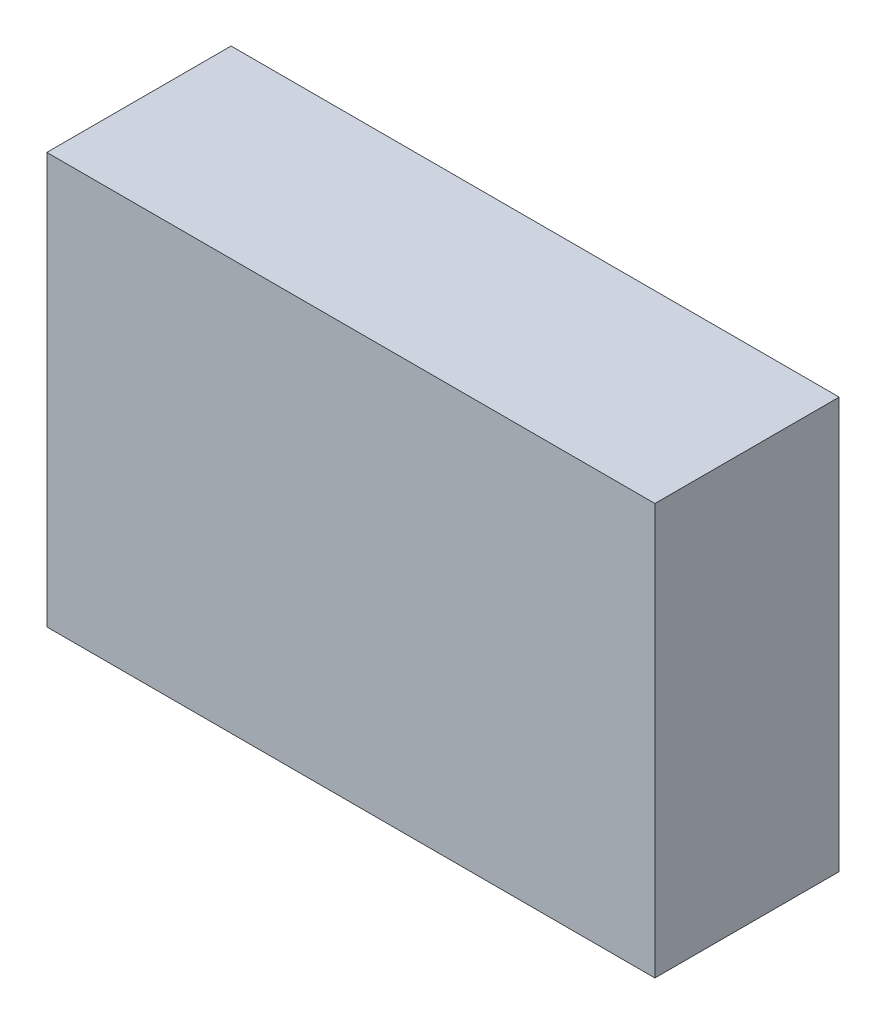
ISO-10303-21;
HEADER;
FILE_DESCRIPTION(('STEP AP214'),'2;1');
FILE_NAME('part.step','',(''),(''),'','','');
FILE_SCHEMA(('AUTOMOTIVE_DESIGN { 1 0 10303 214 1 1 1 1 }'));
ENDSEC;
DATA;
#1=APPLICATION_CONTEXT('core data for automotive mechanical design processes');
#2=APPLICATION_PROTOCOL_DEFINITION('international standard','automotive_design',2000,#1);
#3=PRODUCT_CONTEXT('',#1,'mechanical');
#4=PRODUCT('Part','Part','',(#3));
#5=PRODUCT_RELATED_PRODUCT_CATEGORY('part','',(#4));
#6=PRODUCT_DEFINITION_FORMATION('','',#4);
#7=PRODUCT_DEFINITION_CONTEXT('part definition',#1,'design');
#8=PRODUCT_DEFINITION('design','',#6,#7);
#9=PRODUCT_DEFINITION_SHAPE('','',#8);
#10=(LENGTH_UNIT() NAMED_UNIT(*) SI_UNIT(.MILLI.,.METRE.));
#11=(NAMED_UNIT(*) PLANE_ANGLE_UNIT() SI_UNIT($,.RADIAN.));
#12=(NAMED_UNIT(*) SI_UNIT($,.STERADIAN.) SOLID_ANGLE_UNIT());
#13=UNCERTAINTY_MEASURE_WITH_UNIT(LENGTH_MEASURE(1.E-05),#10,'distance_accuracy_value','');
#14=(GEOMETRIC_REPRESENTATION_CONTEXT(3) GLOBAL_UNCERTAINTY_ASSIGNED_CONTEXT((#13)) GLOBAL_UNIT_ASSIGNED_CONTEXT((#10,
#11,#12)) REPRESENTATION_CONTEXT('',''));
#15=CARTESIAN_POINT('',(0.,0.,0.));
#16=DIRECTION('',(0.,0.,1.));
#17=DIRECTION('',(1.,0.,0.));
#18=AXIS2_PLACEMENT_3D('',#15,#16,#17);
#19=CARTESIAN_POINT('',(-8.25,0.,2.5));
#20=DIRECTION('',(1.,0.,0.));
#21=DIRECTION('',(0.,0.,-1.));
#22=AXIS2_PLACEMENT_3D('',#19,#20,#21);
#23=PLANE('',#22);
#24=DIRECTION('',(0.,-1.,0.));
#25=VECTOR('',#24,1.);
#26=CARTESIAN_POINT('',(-8.25,0.,-2.5));
#27=LINE('',#26,#25);
#28=CARTESIAN_POINT('',(-8.25,11.15,-2.5));
#29=VERTEX_POINT('',#28);
#30=CARTESIAN_POINT('',(-8.25,0.,-2.5));
#31=VERTEX_POINT('',#30);
#32=EDGE_CURVE('E11',#29,#31,#27,.T.);
#33=ORIENTED_EDGE('',*,*,#32,.T.);
#34=DIRECTION('',(0.,0.,-1.));
#35=VECTOR('',#34,1.);
#36=CARTESIAN_POINT('',(-8.25,0.,2.5));
#37=LINE('',#36,#35);
#38=CARTESIAN_POINT('',(-8.25,0.,2.5));
#39=VERTEX_POINT('',#38);
#40=EDGE_CURVE('E36',#39,#31,#37,.T.);
#41=ORIENTED_EDGE('',*,*,#40,.F.);
#42=DIRECTION('',(0.,-1.,0.));
#43=VECTOR('',#42,1.);
#44=CARTESIAN_POINT('',(-8.25,0.,2.5));
#45=LINE('',#44,#43);
#46=CARTESIAN_POINT('',(-8.25,11.15,2.5));
#47=VERTEX_POINT('',#46);
#48=EDGE_CURVE('E73',#47,#39,#45,.T.);
#49=ORIENTED_EDGE('',*,*,#48,.F.);
#50=DIRECTION('',(0.,0.,-1.));
#51=VECTOR('',#50,1.);
#52=CARTESIAN_POINT('',(-8.25,11.15,2.5));
#53=LINE('',#52,#51);
#54=EDGE_CURVE('E27',#47,#29,#53,.T.);
#55=ORIENTED_EDGE('',*,*,#54,.T.);
#56=EDGE_LOOP('',(#33,#41,#49,#55));
#57=FACE_BOUND('',#56,.T.);
#58=ADVANCED_FACE('F17',(#57),#23,.F.);
#59=CARTESIAN_POINT('',(-8.25,0.,2.5));
#60=DIRECTION('',(0.,1.,0.));
#61=DIRECTION('',(0.,0.,1.));
#62=AXIS2_PLACEMENT_3D('',#59,#60,#61);
#63=PLANE('',#62);
#64=DIRECTION('',(1.,0.,0.));
#65=VECTOR('',#64,1.);
#66=CARTESIAN_POINT('',(-8.25,0.,-2.5));
#67=LINE('',#66,#65);
#68=CARTESIAN_POINT('',(8.25,0.,-2.5));
#69=VERTEX_POINT('',#68);
#70=EDGE_CURVE('E80',#31,#69,#67,.T.);
#71=ORIENTED_EDGE('',*,*,#70,.T.);
#72=DIRECTION('',(0.,0.,-1.));
#73=VECTOR('',#72,1.);
#74=CARTESIAN_POINT('',(8.25,0.,2.5));
#75=LINE('',#74,#73);
#76=CARTESIAN_POINT('',(8.25,0.,2.5));
#77=VERTEX_POINT('',#76);
#78=EDGE_CURVE('E86',#77,#69,#75,.T.);
#79=ORIENTED_EDGE('',*,*,#78,.F.);
#80=DIRECTION('',(1.,0.,0.));
#81=VECTOR('',#80,1.);
#82=CARTESIAN_POINT('',(-8.25,0.,2.5));
#83=LINE('',#82,#81);
#84=EDGE_CURVE('E64',#39,#77,#83,.T.);
#85=ORIENTED_EDGE('',*,*,#84,.F.);
#86=ORIENTED_EDGE('',*,*,#40,.T.);
#87=EDGE_LOOP('',(#71,#79,#85,#86));
#88=FACE_BOUND('',#87,.T.);
#89=ADVANCED_FACE('F90',(#88),#63,.F.);
#90=CARTESIAN_POINT('',(8.25,0.,2.5));
#91=DIRECTION('',(-1.,0.,0.));
#92=DIRECTION('',(0.,0.,1.));
#93=AXIS2_PLACEMENT_3D('',#90,#91,#92);
#94=PLANE('',#93);
#95=DIRECTION('',(0.,1.,0.));
#96=VECTOR('',#95,1.);
#97=CARTESIAN_POINT('',(8.25,0.,-2.5));
#98=LINE('',#97,#96);
#99=CARTESIAN_POINT('',(8.25,11.15,-2.5));
#100=VERTEX_POINT('',#99);
#101=EDGE_CURVE('E70',#69,#100,#98,.T.);
#102=ORIENTED_EDGE('',*,*,#101,.T.);
#103=DIRECTION('',(0.,0.,-1.));
#104=VECTOR('',#103,1.);
#105=CARTESIAN_POINT('',(8.25,11.15,2.5));
#106=LINE('',#105,#104);
#107=CARTESIAN_POINT('',(8.25,11.15,2.5));
#108=VERTEX_POINT('',#107);
#109=EDGE_CURVE('E56',#108,#100,#106,.T.);
#110=ORIENTED_EDGE('',*,*,#109,.F.);
#111=DIRECTION('',(0.,1.,0.));
#112=VECTOR('',#111,1.);
#113=CARTESIAN_POINT('',(8.25,0.,2.5));
#114=LINE('',#113,#112);
#115=EDGE_CURVE('E62',#77,#108,#114,.T.);
#116=ORIENTED_EDGE('',*,*,#115,.F.);
#117=ORIENTED_EDGE('',*,*,#78,.T.);
#118=EDGE_LOOP('',(#102,#110,#116,#117));
#119=FACE_BOUND('',#118,.T.);
#120=ADVANCED_FACE('F68',(#119),#94,.F.);
#121=CARTESIAN_POINT('',(-8.25,11.15,2.5));
#122=DIRECTION('',(0.,-1.,0.));
#123=DIRECTION('',(0.,0.,-1.));
#124=AXIS2_PLACEMENT_3D('',#121,#122,#123);
#125=PLANE('',#124);
#126=DIRECTION('',(-1.,0.,0.));
#127=VECTOR('',#126,1.);
#128=CARTESIAN_POINT('',(-8.25,11.15,-2.5));
#129=LINE('',#128,#127);
#130=EDGE_CURVE('E72',#100,#29,#129,.T.);
#131=ORIENTED_EDGE('',*,*,#130,.T.);
#132=ORIENTED_EDGE('',*,*,#54,.F.);
#133=DIRECTION('',(-1.,0.,0.));
#134=VECTOR('',#133,1.);
#135=CARTESIAN_POINT('',(-8.25,11.15,2.5));
#136=LINE('',#135,#134);
#137=EDGE_CURVE('E21',#108,#47,#136,.T.);
#138=ORIENTED_EDGE('',*,*,#137,.F.);
#139=ORIENTED_EDGE('',*,*,#109,.T.);
#140=EDGE_LOOP('',(#131,#132,#138,#139));
#141=FACE_BOUND('',#140,.T.);
#142=ADVANCED_FACE('F76',(#141),#125,.F.);
#143=CARTESIAN_POINT('',(-8.25,11.15,2.5));
#144=DIRECTION('',(0.,0.,-1.));
#145=DIRECTION('',(-1.,0.,0.));
#146=AXIS2_PLACEMENT_3D('',#143,#144,#145);
#147=PLANE('',#146);
#148=ORIENTED_EDGE('',*,*,#48,.T.);
#149=ORIENTED_EDGE('',*,*,#84,.T.);
#150=ORIENTED_EDGE('',*,*,#115,.T.);
#151=ORIENTED_EDGE('',*,*,#137,.T.);
#152=EDGE_LOOP('',(#148,#149,#150,#151));
#153=FACE_BOUND('',#152,.T.);
#154=ADVANCED_FACE('F63',(#153),#147,.F.);
#155=CARTESIAN_POINT('',(-8.25,11.15,-2.5));
#156=DIRECTION('',(0.,0.,-1.));
#157=DIRECTION('',(-1.,0.,0.));
#158=AXIS2_PLACEMENT_3D('',#155,#156,#157);
#159=PLANE('',#158);
#160=ORIENTED_EDGE('',*,*,#32,.F.);
#161=ORIENTED_EDGE('',*,*,#130,.F.);
#162=ORIENTED_EDGE('',*,*,#101,.F.);
#163=ORIENTED_EDGE('',*,*,#70,.F.);
#164=EDGE_LOOP('',(#160,#161,#162,#163));
#165=FACE_BOUND('',#164,.T.);
#166=ADVANCED_FACE('F19',(#165),#159,.T.);
#167=CLOSED_SHELL('',(#58,#89,#120,#142,#154,#166));
#168=MANIFOLD_SOLID_BREP('B1',#167);
#169=ADVANCED_BREP_SHAPE_REPRESENTATION('',(#18,#168),#14);
#170=SHAPE_DEFINITION_REPRESENTATION(#9,#169);
ENDSEC;
END-ISO-10303-21;
